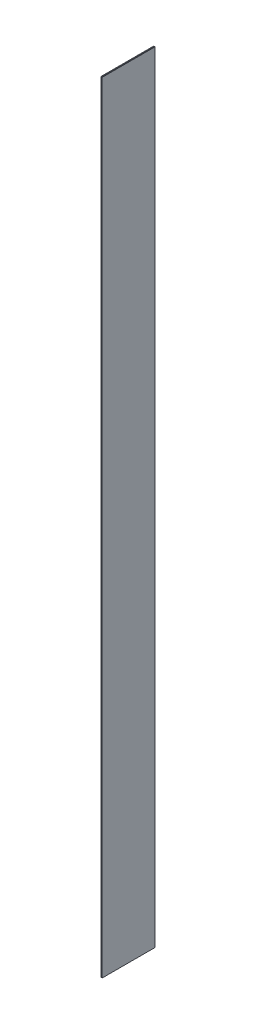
from build123d import *

# Parameters (mm, degrees)
SKETCH1_2_W         = 19.05
SKETCH1_2_H         = 762
BOSS_EXTRUDE2_DEPTH = 11255.781
CHAMFER1_SIZE       = 6


with BuildPart() as part:
    # Sketch1_2 → Boss-Extrude2 (new body)
    with BuildSketch(Plane(origin=(0, 0, 0), x_dir=(-1, 0, 0), z_dir=(0, 1, 0))):
        Rectangle(SKETCH1_2_W, SKETCH1_2_H)
    extrude(amount=BOSS_EXTRUDE2_DEPTH)

    # Chamfer1
    chamfer1_edges = [part.edges().sort_by_distance(p)[0] for p in [
        (9.525, 11255.781, 0),
        (0, 11255.781, -381),
        (-9.525, 11255.781, 0),
        (0, 0, -381),
        (9.525, 0, 0),
        (0, 0, 381),
        (-9.525, 0, 0),
        (0, 11255.781, 381),
    ]]
    chamfer(chamfer1_edges, length=CHAMFER1_SIZE)


solid = part.part
